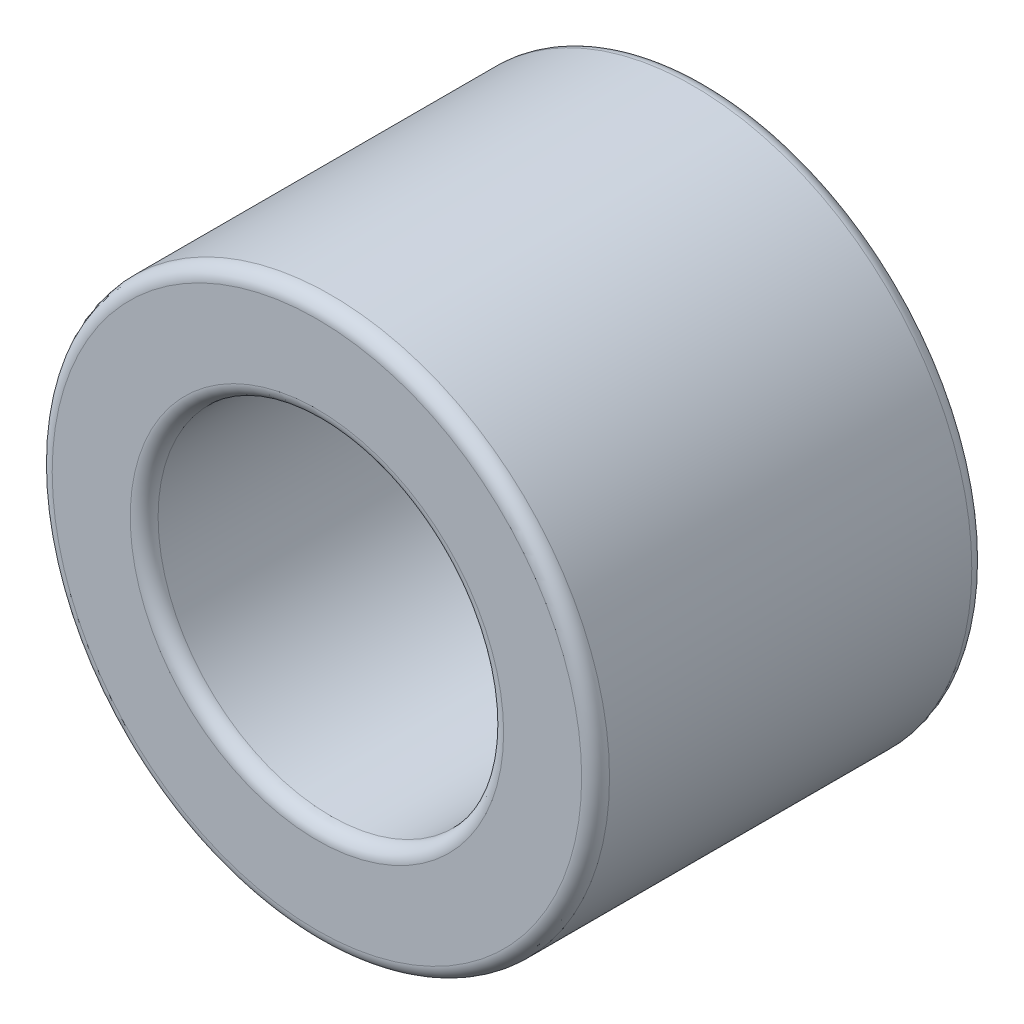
from build123d import *

# Parameters (mm, degrees)
SKETCH_1_R      = 10
SKETCH_1_R_2    = 6.2
EXTRUDE_1_DEPTH = 7
FILLET_1_R      = 0.5


with BuildPart() as part:
    # Sketch 1 → Extrude 1 (new, symmetric)
    with BuildSketch(Plane.XY):
        Circle(SKETCH_1_R)
        Circle(SKETCH_1_R_2, mode=Mode.SUBTRACT)
    extrude(amount=EXTRUDE_1_DEPTH, both=True)

    # Fillet 1
    fillet_1_edges = [part.edges().sort_by_distance(p)[0] for p in [
        (-10, 0, -7),
        (-10, 0, 7),
        (-6.2, 0, -7),
        (-6.2, 0, 7),
    ]]
    fillet(fillet_1_edges, radius=FILLET_1_R)


solid = part.part
